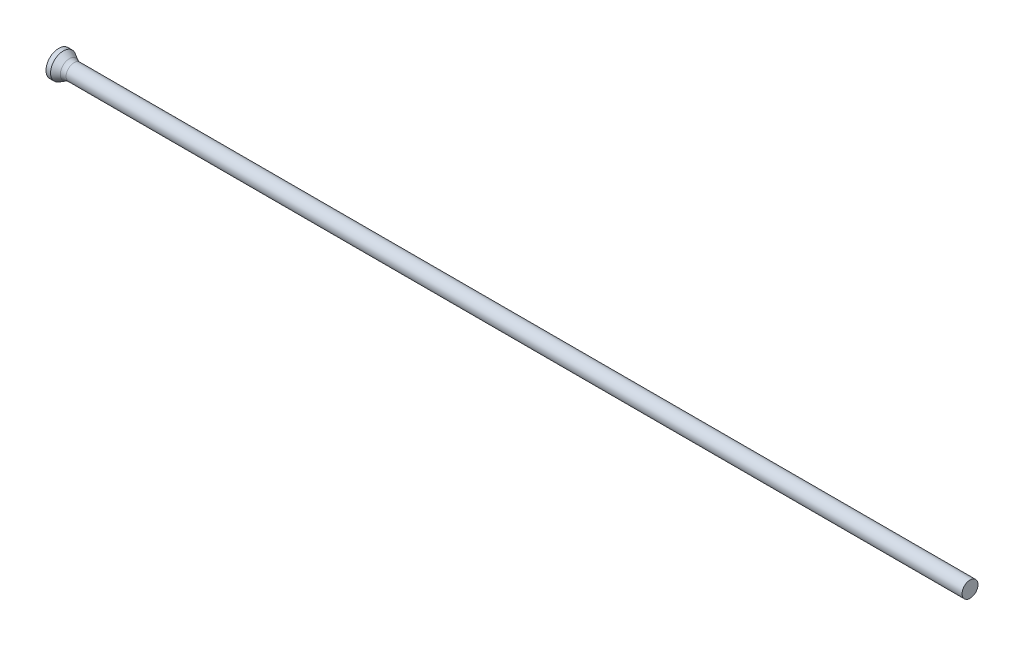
ISO-10303-21;
HEADER;
FILE_DESCRIPTION(('STEP AP214'),'2;1');
FILE_NAME('part.step','',(''),(''),'','','');
FILE_SCHEMA(('AUTOMOTIVE_DESIGN { 1 0 10303 214 1 1 1 1 }'));
ENDSEC;
DATA;
#1=APPLICATION_CONTEXT('core data for automotive mechanical design processes');
#2=APPLICATION_PROTOCOL_DEFINITION('international standard','automotive_design',2000,#1);
#3=PRODUCT_CONTEXT('',#1,'mechanical');
#4=PRODUCT('Part','Part','',(#3));
#5=PRODUCT_RELATED_PRODUCT_CATEGORY('part','',(#4));
#6=PRODUCT_DEFINITION_FORMATION('','',#4);
#7=PRODUCT_DEFINITION_CONTEXT('part definition',#1,'design');
#8=PRODUCT_DEFINITION('design','',#6,#7);
#9=PRODUCT_DEFINITION_SHAPE('','',#8);
#10=(LENGTH_UNIT() NAMED_UNIT(*) SI_UNIT(.MILLI.,.METRE.));
#11=(NAMED_UNIT(*) PLANE_ANGLE_UNIT() SI_UNIT($,.RADIAN.));
#12=(NAMED_UNIT(*) SI_UNIT($,.STERADIAN.) SOLID_ANGLE_UNIT());
#13=UNCERTAINTY_MEASURE_WITH_UNIT(LENGTH_MEASURE(1.E-05),#10,'distance_accuracy_value','');
#14=(GEOMETRIC_REPRESENTATION_CONTEXT(3) GLOBAL_UNCERTAINTY_ASSIGNED_CONTEXT((#13)) GLOBAL_UNIT_ASSIGNED_CONTEXT((#10,
#11,#12)) REPRESENTATION_CONTEXT('',''));
#15=CARTESIAN_POINT('',(0.,0.,0.));
#16=DIRECTION('',(0.,0.,1.));
#17=DIRECTION('',(1.,0.,0.));
#18=AXIS2_PLACEMENT_3D('',#15,#16,#17);
#19=CARTESIAN_POINT('',(0.,0.,0.));
#20=DIRECTION('',(1.,0.,0.));
#21=DIRECTION('',(0.,0.,-1.));
#22=AXIS2_PLACEMENT_3D('',#19,#20,#21);
#23=PLANE('',#22);
#24=CARTESIAN_POINT('',(0.,0.,0.));
#25=DIRECTION('',(-1.,0.,0.));
#26=DIRECTION('',(0.,0.,1.));
#27=AXIS2_PLACEMENT_3D('',#24,#25,#26);
#28=CIRCLE('',#27,1.4);
#29=CARTESIAN_POINT('',(0.,0.,1.4));
#30=VERTEX_POINT('',#29);
#31=EDGE_CURVE('E25',#30,#30,#28,.T.);
#32=ORIENTED_EDGE('',*,*,#31,.T.);
#33=EDGE_LOOP('',(#32));
#34=FACE_BOUND('',#33,.T.);
#35=ADVANCED_FACE('F14',(#34),#23,.F.);
#36=CARTESIAN_POINT('',(0.,0.,0.));
#37=DIRECTION('',(-1.,0.,0.));
#38=DIRECTION('',(0.,0.,1.));
#39=AXIS2_PLACEMENT_3D('',#36,#37,#38);
#40=CYLINDRICAL_SURFACE('',#39,1.4);
#41=ORIENTED_EDGE('',*,*,#31,.F.);
#42=EDGE_LOOP('',(#41));
#43=FACE_BOUND('',#42,.T.);
#44=CARTESIAN_POINT('',(0.500673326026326,0.,0.));
#45=DIRECTION('',(-1.,0.,0.));
#46=DIRECTION('',(0.,0.,1.));
#47=AXIS2_PLACEMENT_3D('',#44,#45,#46);
#48=CIRCLE('',#47,1.4);
#49=CARTESIAN_POINT('',(0.500673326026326,0.,1.4));
#50=VERTEX_POINT('',#49);
#51=EDGE_CURVE('E29',#50,#50,#48,.T.);
#52=ORIENTED_EDGE('',*,*,#51,.T.);
#53=EDGE_LOOP('',(#52));
#54=FACE_BOUND('',#53,.T.);
#55=ADVANCED_FACE('F53',(#43,#54),#40,.T.);
#56=CARTESIAN_POINT('',(1.41,0.,0.));
#57=DIRECTION('',(-1.,0.,0.));
#58=DIRECTION('',(0.,0.,1.));
#59=AXIS2_PLACEMENT_3D('',#56,#57,#58);
#60=CONICAL_SURFACE('',#59,0.875,0.523598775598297);
#61=CARTESIAN_POINT('',(1.17794919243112,0.,0.));
#62=DIRECTION('',(-1.,0.,0.));
#63=DIRECTION('',(0.,0.,1.));
#64=AXIS2_PLACEMENT_3D('',#61,#62,#63);
#65=CIRCLE('',#64,1.00897459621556);
#66=CARTESIAN_POINT('',(1.17794919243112,0.,1.00897459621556));
#67=VERTEX_POINT('',#66);
#68=EDGE_CURVE('E21',#67,#67,#65,.T.);
#69=ORIENTED_EDGE('',*,*,#68,.T.);
#70=EDGE_LOOP('',(#69));
#71=FACE_BOUND('',#70,.T.);
#72=ORIENTED_EDGE('',*,*,#51,.F.);
#73=EDGE_LOOP('',(#72));
#74=FACE_BOUND('',#73,.T.);
#75=ADVANCED_FACE('F50',(#71,#74),#60,.T.);
#76=CARTESIAN_POINT('',(0.,0.,0.));
#77=DIRECTION('',(-1.,0.,0.));
#78=DIRECTION('',(0.,0.,1.));
#79=AXIS2_PLACEMENT_3D('',#76,#77,#78);
#80=CYLINDRICAL_SURFACE('',#79,0.875);
#81=CARTESIAN_POINT('',(1.67794919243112,0.,0.));
#82=DIRECTION('',(-1.,0.,0.));
#83=DIRECTION('',(0.,0.,1.));
#84=AXIS2_PLACEMENT_3D('',#81,#82,#83);
#85=CIRCLE('',#84,0.875);
#86=CARTESIAN_POINT('',(1.67794919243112,0.,0.875));
#87=VERTEX_POINT('',#86);
#88=EDGE_CURVE('E9',#87,#87,#85,.F.);
#89=ORIENTED_EDGE('',*,*,#88,.T.);
#90=EDGE_LOOP('',(#89));
#91=FACE_BOUND('',#90,.T.);
#92=CARTESIAN_POINT('',(100.,0.,0.));
#93=DIRECTION('',(-1.,0.,0.));
#94=DIRECTION('',(0.,0.,1.));
#95=AXIS2_PLACEMENT_3D('',#92,#93,#94);
#96=CIRCLE('',#95,0.875);
#97=CARTESIAN_POINT('',(100.,0.,0.875));
#98=VERTEX_POINT('',#97);
#99=EDGE_CURVE('E34',#98,#98,#96,.T.);
#100=ORIENTED_EDGE('',*,*,#99,.T.);
#101=EDGE_LOOP('',(#100));
#102=FACE_BOUND('',#101,.T.);
#103=ADVANCED_FACE('F38',(#91,#102),#80,.T.);
#104=CARTESIAN_POINT('',(100.,0.875,0.));
#105=DIRECTION('',(-1.,0.,0.));
#106=DIRECTION('',(0.,0.,1.));
#107=AXIS2_PLACEMENT_3D('',#104,#105,#106);
#108=PLANE('',#107);
#109=ORIENTED_EDGE('',*,*,#99,.F.);
#110=EDGE_LOOP('',(#109));
#111=FACE_BOUND('',#110,.T.);
#112=ADVANCED_FACE('F40',(#111),#108,.F.);
#113=CARTESIAN_POINT('',(1.67794919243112,0.,0.));
#114=DIRECTION('',(-1.,0.,0.));
#115=DIRECTION('',(0.,0.,1.));
#116=AXIS2_PLACEMENT_3D('',#113,#114,#115);
#117=TOROIDAL_SURFACE('',#116,1.875,1.);
#118=ORIENTED_EDGE('',*,*,#88,.F.);
#119=EDGE_LOOP('',(#118));
#120=FACE_BOUND('',#119,.T.);
#121=ORIENTED_EDGE('',*,*,#68,.F.);
#122=EDGE_LOOP('',(#121));
#123=FACE_BOUND('',#122,.T.);
#124=ADVANCED_FACE('F16',(#120,#123),#117,.F.);
#125=CLOSED_SHELL('',(#35,#55,#75,#103,#112,#124));
#126=MANIFOLD_SOLID_BREP('B1',#125);
#127=ADVANCED_BREP_SHAPE_REPRESENTATION('',(#18,#126),#14);
#128=SHAPE_DEFINITION_REPRESENTATION(#9,#127);
ENDSEC;
END-ISO-10303-21;
